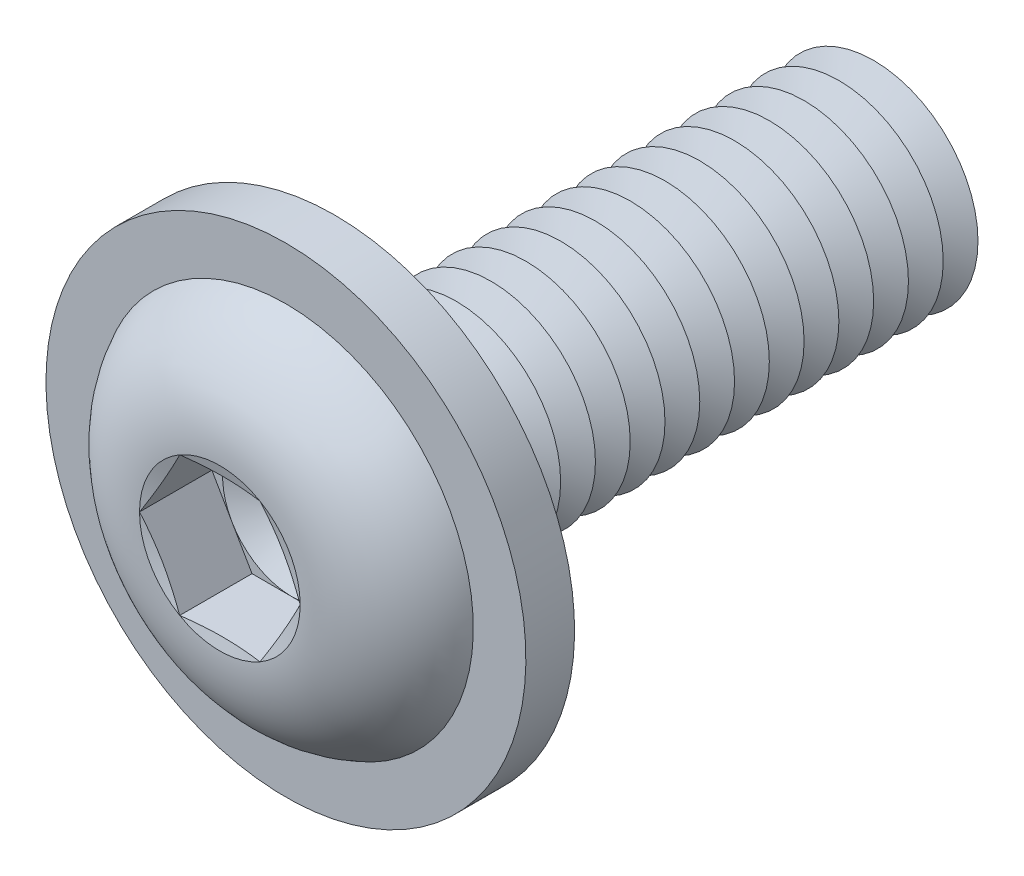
from build123d import *

# Parameters (mm, degrees)
FILLET1_R           = 0.25
LPATTERN1_COUNT     = 16
LPATTERN1_PITCH     = 0.5
CUT_EXTRUDE1_DEPTH  = 1.04
SKETCH5_R           = 3.45
SKETCH5_R_2         = 1.75
BOSS_EXTRUDE1_DEPTH = 0.7


with BuildPart() as part:
    # Sketch1 → Revolve1 (revolve)
    with BuildSketch(Plane(origin=(0, 0, 0), x_dir=(0, 0, -1), z_dir=(1, 0, 0)), mode=Mode.PRIVATE) as revolve1_sk:
        with BuildLine():
            Line((0, 1.5), (0, 2.85))
            ThreePointArc((0, 2.85), (-1.182850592, 2.35063849), (-1.65, 1.1547))
            Line((-1.65, 1.1547), (-1.495299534, 0.57735))
            Line((-1.495299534, 0.57735), (-1.65, 0.57735))
            Line((-1.65, 0.57735), (-1.65, 0))
            Line((-1.65, 0), (8, 0))
            Line((8, 0), (8, 1.5))
            Line((8, 1.5), (0, 1.5))
        make_face()
    revolve(revolve1_sk.sketch.rotate(Axis((0, 0, -8), (0, 0, 1)), 90), axis=Axis((0, 0, -8), (0, 0, 1)))

    # Fillet1
    fillet1_edges = [part.edges().sort_by_distance(p)[0] for p in [
        (1.5, 0, 0),
    ]]
    fillet(fillet1_edges, radius=FILLET1_R)

    # Sketch2 → Cut-Revolve1 (revolve, cut)
    with BuildSketch(Plane(origin=(0, 0, 0), x_dir=(0, 0, -1), z_dir=(1, 0, 0)), mode=Mode.PRIVATE) as cut_revolve1_sk:
        Polygon((7.75, 1.5), (8.25, 1.5), (8, 1.066987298), align=None)
    cut_revolve1 = revolve(cut_revolve1_sk.sketch.rotate(Axis((0, 0, -8), (0, 0, -1)), 270), axis=Axis((0, 0, -8), (0, 0, -1)), mode=Mode.SUBTRACT)

    # LPattern1: Cut-Revolve1 ×16
    with Locations(*[(0, 0, i * LPATTERN1_PITCH) for i in range(1, LPATTERN1_COUNT)]):
        add(cut_revolve1, mode=Mode.SUBTRACT)

    # Sketch3 → Cut-Extrude1 (cut)
    with BuildSketch(Plane.XY.offset(1.65)):
        Polygon((0.57735, 0.999999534), (-0.57735, 0.999999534), (-1.1547, 0), (-0.57735, -0.999999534), (0.57735, -0.999999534), (1.1547, 0), align=None)
    extrude(amount=-CUT_EXTRUDE1_DEPTH, mode=Mode.SUBTRACT)

    # Cut-Extrude2 cone 1 section (on through the dimple's axis) → Cut-Extrude2 (revolve, cut)
    with BuildSketch(Plane(origin=(0, 0, 0.61), x_dir=(0, -1, 0), z_dir=(1, 0, 0))):
        Polygon((0, 0), (0.999999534, 0), (0, 0.57735), align=None)
    revolve(axis=Axis((0, 0, 0.61), (0, 0, -1)), mode=Mode.SUBTRACT)

    # Sketch5 → Boss-Extrude1 (add)
    with BuildSketch(Plane(origin=(0, 0, 0), x_dir=(-1, 0, 0), z_dir=(0, 0, -1))):
        with Locations(Location((0, 0, 0), (0, 0, 90))):
            Circle(SKETCH5_R)
        Circle(SKETCH5_R_2, mode=Mode.SUBTRACT)
    extrude(amount=-BOSS_EXTRUDE1_DEPTH)


solid = part.part
